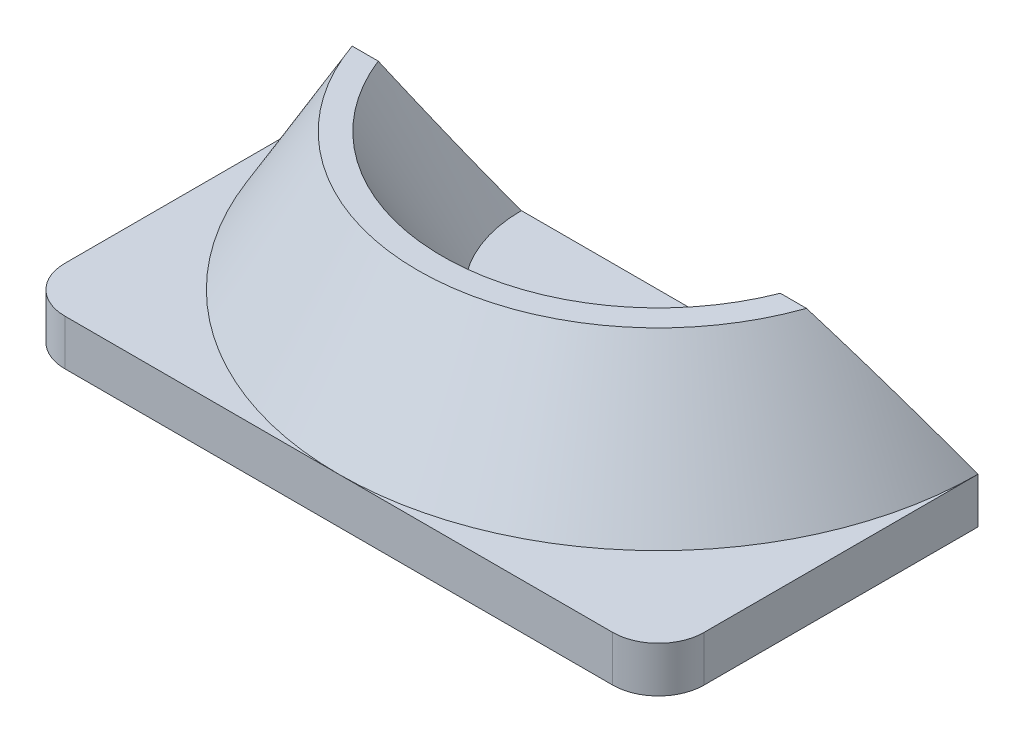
from build123d import *

# Parameters (mm, degrees)
EXTRUDE1_DEPTH = 5
EXTRUDE2_DEPTH = 15
EXTRUDE2_DRAFT = 30


with BuildPart() as part:
    # Sketch1 → Extrude1 (new body)
    with BuildSketch(Plane(origin=(0, 0, 0), x_dir=(1, 0, 0), z_dir=(0, 1, 0))):
        with BuildLine():
            Line((-35, 0), (35, 0))
            Line((35, 0), (35, -30))
            ThreePointArc((35, -30), (33.535533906, -33.535533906), (30, -35))
            Line((30, -35), (-30, -35))
            ThreePointArc((-30, -35), (-33.535533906, -33.535533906), (-35, -30))
            Line((-35, -30), (-35, 0))
        make_face()
    extrude(amount=EXTRUDE1_DEPTH)


with BuildPart() as extrude2_tool:
    # Sketch2 → Extrude2 (with draft: the straight prism first)
    with BuildSketch(Plane(origin=(0, 5, 0), x_dir=(-1, 0, 0), z_dir=(0, 1, 0))):
        with BuildLine():
            ThreePointArc((35, 0), (0, 35), (-35, 0))
            Line((-35, 0), (-15, 0))
            ThreePointArc((-15, 0), (0, 15), (15, 0))
            Line((15, 0), (35, 0))
        make_face()
    extrude(amount=EXTRUDE2_DEPTH)
    # Extrude2: the draft: its side faces are tilted about the plane it starts from
    extrude2_sides = [extrude2_tool.faces().sort_by_distance(p)[0] for p in [
        (25, 12.5, 0),
        (0, 12.5, 15),
        (-25, 12.5, 0),
        (0, 12.5, 35),
    ]]
    draft(extrude2_sides, Plane(origin=(0, 5, 0), x_dir=(-1, 0, 0), z_dir=(0, 1, 0)), EXTRUDE2_DRAFT)


with BuildPart() as part_1:
    add(part.part)

    # Extrude2: add extrude2_tool
    add(extrude2_tool.part)


solid = part_1.part
